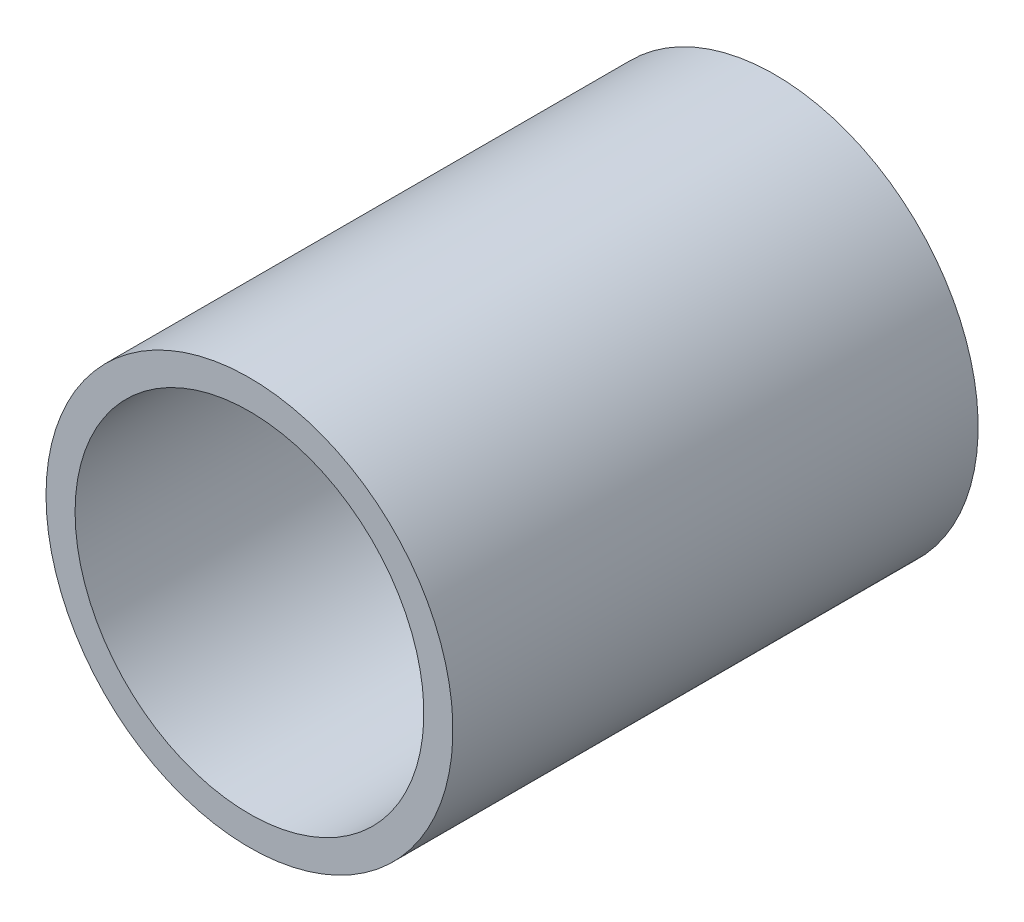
ISO-10303-21;
HEADER;
FILE_DESCRIPTION(('STEP AP214'),'2;1');
FILE_NAME('part.step','',(''),(''),'','','');
FILE_SCHEMA(('AUTOMOTIVE_DESIGN { 1 0 10303 214 1 1 1 1 }'));
ENDSEC;
DATA;
#1=APPLICATION_CONTEXT('core data for automotive mechanical design processes');
#2=APPLICATION_PROTOCOL_DEFINITION('international standard','automotive_design',2000,#1);
#3=PRODUCT_CONTEXT('',#1,'mechanical');
#4=PRODUCT('Part','Part','',(#3));
#5=PRODUCT_RELATED_PRODUCT_CATEGORY('part','',(#4));
#6=PRODUCT_DEFINITION_FORMATION('','',#4);
#7=PRODUCT_DEFINITION_CONTEXT('part definition',#1,'design');
#8=PRODUCT_DEFINITION('design','',#6,#7);
#9=PRODUCT_DEFINITION_SHAPE('','',#8);
#10=(LENGTH_UNIT() NAMED_UNIT(*) SI_UNIT(.MILLI.,.METRE.));
#11=(NAMED_UNIT(*) PLANE_ANGLE_UNIT() SI_UNIT($,.RADIAN.));
#12=(NAMED_UNIT(*) SI_UNIT($,.STERADIAN.) SOLID_ANGLE_UNIT());
#13=UNCERTAINTY_MEASURE_WITH_UNIT(LENGTH_MEASURE(1.E-05),#10,'distance_accuracy_value','');
#14=(GEOMETRIC_REPRESENTATION_CONTEXT(3) GLOBAL_UNCERTAINTY_ASSIGNED_CONTEXT((#13)) GLOBAL_UNIT_ASSIGNED_CONTEXT((#10,
#11,#12)) REPRESENTATION_CONTEXT('',''));
#15=CARTESIAN_POINT('',(0.,0.,0.));
#16=DIRECTION('',(0.,0.,1.));
#17=DIRECTION('',(1.,0.,0.));
#18=AXIS2_PLACEMENT_3D('',#15,#16,#17);
#19=CARTESIAN_POINT('',(0.,0.,-6393.32));
#20=DIRECTION('',(0.,0.,-1.));
#21=DIRECTION('',(-1.,0.,0.));
#22=AXIS2_PLACEMENT_3D('',#19,#20,#21);
#23=CYLINDRICAL_SURFACE('',#22,15.);
#24=CARTESIAN_POINT('',(0.,0.,-169.774687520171));
#25=DIRECTION('',(0.,0.,-1.));
#26=DIRECTION('',(-1.,0.,0.));
#27=AXIS2_PLACEMENT_3D('',#24,#25,#26);
#28=CIRCLE('',#27,15.);
#29=CARTESIAN_POINT('',(-15.,0.,-169.774687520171));
#30=VERTEX_POINT('',#29);
#31=EDGE_CURVE('E10',#30,#30,#28,.T.);
#32=ORIENTED_EDGE('',*,*,#31,.F.);
#33=EDGE_LOOP('',(#32));
#34=FACE_BOUND('',#33,.T.);
#35=CARTESIAN_POINT('',(0.,0.,-214.9546875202));
#36=DIRECTION('',(0.,0.,-1.));
#37=DIRECTION('',(-1.,0.,0.));
#38=AXIS2_PLACEMENT_3D('',#35,#36,#37);
#39=CIRCLE('',#38,15.);
#40=CARTESIAN_POINT('',(-15.,0.,-214.9546875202));
#41=VERTEX_POINT('',#40);
#42=EDGE_CURVE('E49',#41,#41,#39,.T.);
#43=ORIENTED_EDGE('',*,*,#42,.T.);
#44=EDGE_LOOP('',(#43));
#45=FACE_BOUND('',#44,.T.);
#46=ADVANCED_FACE('F34',(#34,#45),#23,.F.);
#47=CARTESIAN_POINT('',(0.,0.,-6393.32));
#48=DIRECTION('',(0.,0.,-1.));
#49=DIRECTION('',(-1.,0.,0.));
#50=AXIS2_PLACEMENT_3D('',#47,#48,#49);
#51=CYLINDRICAL_SURFACE('',#50,17.5);
#52=CARTESIAN_POINT('',(0.,0.,-169.774687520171));
#53=DIRECTION('',(0.,0.,-1.));
#54=DIRECTION('',(-1.,0.,0.));
#55=AXIS2_PLACEMENT_3D('',#52,#53,#54);
#56=CIRCLE('',#55,17.5);
#57=CARTESIAN_POINT('',(-17.5,0.,-169.774687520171));
#58=VERTEX_POINT('',#57);
#59=EDGE_CURVE('E38',#58,#58,#56,.T.);
#60=ORIENTED_EDGE('',*,*,#59,.T.);
#61=EDGE_LOOP('',(#60));
#62=FACE_BOUND('',#61,.T.);
#63=CARTESIAN_POINT('',(0.,0.,-214.9546875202));
#64=DIRECTION('',(0.,0.,-1.));
#65=DIRECTION('',(-1.,0.,0.));
#66=AXIS2_PLACEMENT_3D('',#63,#64,#65);
#67=CIRCLE('',#66,17.5);
#68=CARTESIAN_POINT('',(-17.5,0.,-214.9546875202));
#69=VERTEX_POINT('',#68);
#70=EDGE_CURVE('E45',#69,#69,#67,.F.);
#71=ORIENTED_EDGE('',*,*,#70,.T.);
#72=EDGE_LOOP('',(#71));
#73=FACE_BOUND('',#72,.T.);
#74=ADVANCED_FACE('F36',(#62,#73),#51,.T.);
#75=CARTESIAN_POINT('',(11.01259271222,21.,-169.774687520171));
#76=DIRECTION('',(0.,0.,1.));
#77=DIRECTION('',(1.,0.,0.));
#78=AXIS2_PLACEMENT_3D('',#75,#76,#77);
#79=PLANE('',#78);
#80=ORIENTED_EDGE('',*,*,#31,.T.);
#81=EDGE_LOOP('',(#80));
#82=FACE_BOUND('',#81,.T.);
#83=ORIENTED_EDGE('',*,*,#59,.F.);
#84=EDGE_LOOP('',(#83));
#85=FACE_BOUND('',#84,.T.);
#86=ADVANCED_FACE('F57',(#82,#85),#79,.T.);
#87=CARTESIAN_POINT('',(11.01259271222,21.,-214.9546875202));
#88=DIRECTION('',(0.,0.,1.));
#89=DIRECTION('',(1.,0.,0.));
#90=AXIS2_PLACEMENT_3D('',#87,#88,#89);
#91=PLANE('',#90);
#92=ORIENTED_EDGE('',*,*,#42,.F.);
#93=EDGE_LOOP('',(#92));
#94=FACE_BOUND('',#93,.T.);
#95=ORIENTED_EDGE('',*,*,#70,.F.);
#96=EDGE_LOOP('',(#95));
#97=FACE_BOUND('',#96,.T.);
#98=ADVANCED_FACE('F54',(#94,#97),#91,.F.);
#99=CLOSED_SHELL('',(#46,#74,#86,#98));
#100=MANIFOLD_SOLID_BREP('B2',#99);
#101=ADVANCED_BREP_SHAPE_REPRESENTATION('',(#18,#100),#14);
#102=SHAPE_DEFINITION_REPRESENTATION(#9,#101);
ENDSEC;
END-ISO-10303-21;
